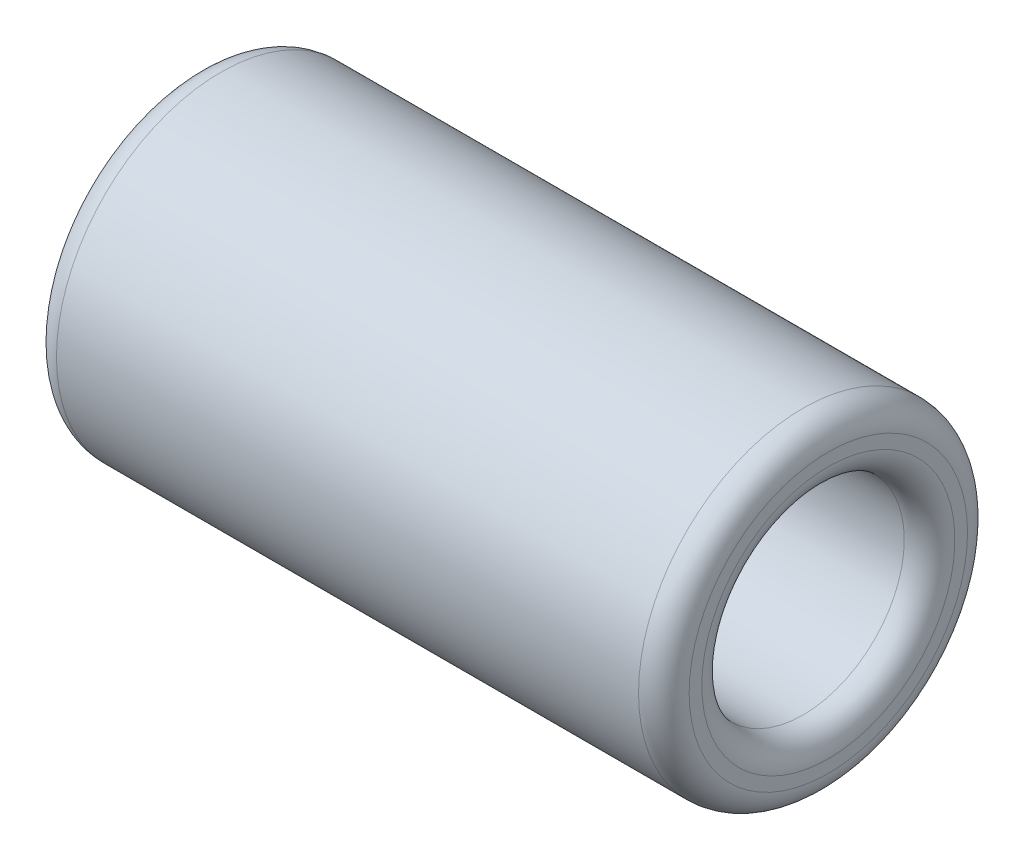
ISO-10303-21;
HEADER;
FILE_DESCRIPTION(('STEP AP214'),'2;1');
FILE_NAME('part.step','',(''),(''),'','','');
FILE_SCHEMA(('AUTOMOTIVE_DESIGN { 1 0 10303 214 1 1 1 1 }'));
ENDSEC;
DATA;
#1=APPLICATION_CONTEXT('core data for automotive mechanical design processes');
#2=APPLICATION_PROTOCOL_DEFINITION('international standard','automotive_design',2000,#1);
#3=PRODUCT_CONTEXT('',#1,'mechanical');
#4=PRODUCT('Part','Part','',(#3));
#5=PRODUCT_RELATED_PRODUCT_CATEGORY('part','',(#4));
#6=PRODUCT_DEFINITION_FORMATION('','',#4);
#7=PRODUCT_DEFINITION_CONTEXT('part definition',#1,'design');
#8=PRODUCT_DEFINITION('design','',#6,#7);
#9=PRODUCT_DEFINITION_SHAPE('','',#8);
#10=(LENGTH_UNIT() NAMED_UNIT(*) SI_UNIT(.MILLI.,.METRE.));
#11=(NAMED_UNIT(*) PLANE_ANGLE_UNIT() SI_UNIT($,.RADIAN.));
#12=(NAMED_UNIT(*) SI_UNIT($,.STERADIAN.) SOLID_ANGLE_UNIT());
#13=UNCERTAINTY_MEASURE_WITH_UNIT(LENGTH_MEASURE(1.E-05),#10,'distance_accuracy_value','');
#14=(GEOMETRIC_REPRESENTATION_CONTEXT(3) GLOBAL_UNCERTAINTY_ASSIGNED_CONTEXT((#13)) GLOBAL_UNIT_ASSIGNED_CONTEXT((#10,
#11,#12)) REPRESENTATION_CONTEXT('',''));
#15=CARTESIAN_POINT('',(0.,0.,0.));
#16=DIRECTION('',(0.,0.,1.));
#17=DIRECTION('',(1.,0.,0.));
#18=AXIS2_PLACEMENT_3D('',#15,#16,#17);
#19=CARTESIAN_POINT('',(0.4,0.,0.));
#20=DIRECTION('',(-1.,0.,0.));
#21=DIRECTION('',(0.,0.,1.));
#22=AXIS2_PLACEMENT_3D('',#19,#20,#21);
#23=TOROIDAL_SURFACE('',#22,2.,0.4);
#24=CARTESIAN_POINT('',(0.400000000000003,0.,0.));
#25=DIRECTION('',(-1.,0.,0.));
#26=DIRECTION('',(0.,0.,1.));
#27=AXIS2_PLACEMENT_3D('',#24,#25,#26);
#28=CIRCLE('',#27,1.6);
#29=CARTESIAN_POINT('',(0.400000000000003,0.,1.6));
#30=VERTEX_POINT('',#29);
#31=EDGE_CURVE('E70',#30,#30,#28,.T.);
#32=ORIENTED_EDGE('',*,*,#31,.F.);
#33=EDGE_LOOP('',(#32));
#34=FACE_BOUND('',#33,.T.);
#35=CARTESIAN_POINT('',(0.,0.,0.));
#36=DIRECTION('',(-1.,0.,0.));
#37=DIRECTION('',(0.,0.,1.));
#38=AXIS2_PLACEMENT_3D('',#35,#36,#37);
#39=CIRCLE('',#38,2.);
#40=CARTESIAN_POINT('',(0.,0.,2.));
#41=VERTEX_POINT('',#40);
#42=EDGE_CURVE('E10',#41,#41,#39,.T.);
#43=ORIENTED_EDGE('',*,*,#42,.T.);
#44=EDGE_LOOP('',(#43));
#45=FACE_BOUND('',#44,.T.);
#46=ADVANCED_FACE('F34',(#34,#45),#23,.T.);
#47=CARTESIAN_POINT('',(0.,2.,0.));
#48=DIRECTION('',(1.,0.,0.));
#49=DIRECTION('',(0.,0.,-1.));
#50=AXIS2_PLACEMENT_3D('',#47,#48,#49);
#51=PLANE('',#50);
#52=ORIENTED_EDGE('',*,*,#42,.F.);
#53=EDGE_LOOP('',(#52));
#54=FACE_BOUND('',#53,.T.);
#55=CARTESIAN_POINT('',(0.,0.,0.));
#56=DIRECTION('',(-1.,0.,0.));
#57=DIRECTION('',(0.,0.,1.));
#58=AXIS2_PLACEMENT_3D('',#55,#56,#57);
#59=CIRCLE('',#58,2.2);
#60=CARTESIAN_POINT('',(0.,0.,2.2));
#61=VERTEX_POINT('',#60);
#62=EDGE_CURVE('E41',#61,#61,#59,.T.);
#63=ORIENTED_EDGE('',*,*,#62,.T.);
#64=EDGE_LOOP('',(#63));
#65=FACE_BOUND('',#64,.T.);
#66=ADVANCED_FACE('F77',(#54,#65),#51,.F.);
#67=CARTESIAN_POINT('',(0.4,0.,0.));
#68=DIRECTION('',(-1.,0.,0.));
#69=DIRECTION('',(0.,0.,1.));
#70=AXIS2_PLACEMENT_3D('',#67,#68,#69);
#71=TOROIDAL_SURFACE('',#70,2.2,0.4);
#72=ORIENTED_EDGE('',*,*,#62,.F.);
#73=EDGE_LOOP('',(#72));
#74=FACE_BOUND('',#73,.T.);
#75=CARTESIAN_POINT('',(0.400000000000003,0.,0.));
#76=DIRECTION('',(-1.,0.,0.));
#77=DIRECTION('',(0.,0.,1.));
#78=AXIS2_PLACEMENT_3D('',#75,#76,#77);
#79=CIRCLE('',#78,2.6);
#80=CARTESIAN_POINT('',(0.400000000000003,0.,2.6));
#81=VERTEX_POINT('',#80);
#82=EDGE_CURVE('E47',#81,#81,#79,.T.);
#83=ORIENTED_EDGE('',*,*,#82,.T.);
#84=EDGE_LOOP('',(#83));
#85=FACE_BOUND('',#84,.T.);
#86=ADVANCED_FACE('F81',(#74,#85),#71,.T.);
#87=CARTESIAN_POINT('',(0.,0.,0.));
#88=DIRECTION('',(-1.,0.,0.));
#89=DIRECTION('',(0.,0.,1.));
#90=AXIS2_PLACEMENT_3D('',#87,#88,#89);
#91=CYLINDRICAL_SURFACE('',#90,2.6);
#92=ORIENTED_EDGE('',*,*,#82,.F.);
#93=EDGE_LOOP('',(#92));
#94=FACE_BOUND('',#93,.T.);
#95=CARTESIAN_POINT('',(9.6,0.,0.));
#96=DIRECTION('',(-1.,0.,0.));
#97=DIRECTION('',(0.,0.,1.));
#98=AXIS2_PLACEMENT_3D('',#95,#96,#97);
#99=CIRCLE('',#98,2.6);
#100=CARTESIAN_POINT('',(9.6,0.,2.6));
#101=VERTEX_POINT('',#100);
#102=EDGE_CURVE('E53',#101,#101,#99,.T.);
#103=ORIENTED_EDGE('',*,*,#102,.T.);
#104=EDGE_LOOP('',(#103));
#105=FACE_BOUND('',#104,.T.);
#106=ADVANCED_FACE('F86',(#94,#105),#91,.T.);
#107=CARTESIAN_POINT('',(9.6,0.,0.));
#108=DIRECTION('',(-1.,0.,0.));
#109=DIRECTION('',(0.,0.,1.));
#110=AXIS2_PLACEMENT_3D('',#107,#108,#109);
#111=TOROIDAL_SURFACE('',#110,2.2,0.4);
#112=ORIENTED_EDGE('',*,*,#102,.F.);
#113=EDGE_LOOP('',(#112));
#114=FACE_BOUND('',#113,.T.);
#115=CARTESIAN_POINT('',(10.,0.,0.));
#116=DIRECTION('',(-1.,0.,0.));
#117=DIRECTION('',(0.,0.,1.));
#118=AXIS2_PLACEMENT_3D('',#115,#116,#117);
#119=CIRCLE('',#118,2.2);
#120=CARTESIAN_POINT('',(10.,0.,2.2));
#121=VERTEX_POINT('',#120);
#122=EDGE_CURVE('E58',#121,#121,#119,.T.);
#123=ORIENTED_EDGE('',*,*,#122,.T.);
#124=EDGE_LOOP('',(#123));
#125=FACE_BOUND('',#124,.T.);
#126=ADVANCED_FACE('F92',(#114,#125),#111,.T.);
#127=CARTESIAN_POINT('',(10.,2.,0.));
#128=DIRECTION('',(-1.,0.,0.));
#129=DIRECTION('',(0.,0.,1.));
#130=AXIS2_PLACEMENT_3D('',#127,#128,#129);
#131=PLANE('',#130);
#132=ORIENTED_EDGE('',*,*,#122,.F.);
#133=EDGE_LOOP('',(#132));
#134=FACE_BOUND('',#133,.T.);
#135=CARTESIAN_POINT('',(10.,0.,0.));
#136=DIRECTION('',(-1.,0.,0.));
#137=DIRECTION('',(0.,0.,1.));
#138=AXIS2_PLACEMENT_3D('',#135,#136,#137);
#139=CIRCLE('',#138,2.);
#140=CARTESIAN_POINT('',(10.,0.,2.));
#141=VERTEX_POINT('',#140);
#142=EDGE_CURVE('E62',#141,#141,#139,.T.);
#143=ORIENTED_EDGE('',*,*,#142,.T.);
#144=EDGE_LOOP('',(#143));
#145=FACE_BOUND('',#144,.T.);
#146=ADVANCED_FACE('F96',(#134,#145),#131,.F.);
#147=CARTESIAN_POINT('',(9.6,0.,0.));
#148=DIRECTION('',(-1.,0.,0.));
#149=DIRECTION('',(0.,0.,1.));
#150=AXIS2_PLACEMENT_3D('',#147,#148,#149);
#151=TOROIDAL_SURFACE('',#150,2.,0.4);
#152=ORIENTED_EDGE('',*,*,#142,.F.);
#153=EDGE_LOOP('',(#152));
#154=FACE_BOUND('',#153,.T.);
#155=CARTESIAN_POINT('',(9.6,0.,0.));
#156=DIRECTION('',(-1.,0.,0.));
#157=DIRECTION('',(0.,0.,1.));
#158=AXIS2_PLACEMENT_3D('',#155,#156,#157);
#159=CIRCLE('',#158,1.6);
#160=CARTESIAN_POINT('',(9.6,0.,1.6));
#161=VERTEX_POINT('',#160);
#162=EDGE_CURVE('E66',#161,#161,#159,.T.);
#163=ORIENTED_EDGE('',*,*,#162,.T.);
#164=EDGE_LOOP('',(#163));
#165=FACE_BOUND('',#164,.T.);
#166=ADVANCED_FACE('F100',(#154,#165),#151,.T.);
#167=CARTESIAN_POINT('',(0.,0.,0.));
#168=DIRECTION('',(-1.,0.,0.));
#169=DIRECTION('',(0.,0.,1.));
#170=AXIS2_PLACEMENT_3D('',#167,#168,#169);
#171=CYLINDRICAL_SURFACE('',#170,1.6);
#172=ORIENTED_EDGE('',*,*,#162,.F.);
#173=EDGE_LOOP('',(#172));
#174=FACE_BOUND('',#173,.T.);
#175=ORIENTED_EDGE('',*,*,#31,.T.);
#176=EDGE_LOOP('',(#175));
#177=FACE_BOUND('',#176,.T.);
#178=ADVANCED_FACE('F74',(#174,#177),#171,.F.);
#179=CLOSED_SHELL('',(#46,#66,#86,#106,#126,#146,#166,#178));
#180=MANIFOLD_SOLID_BREP('B2',#179);
#181=ADVANCED_BREP_SHAPE_REPRESENTATION('',(#18,#180),#14);
#182=SHAPE_DEFINITION_REPRESENTATION(#9,#181);
ENDSEC;
END-ISO-10303-21;
